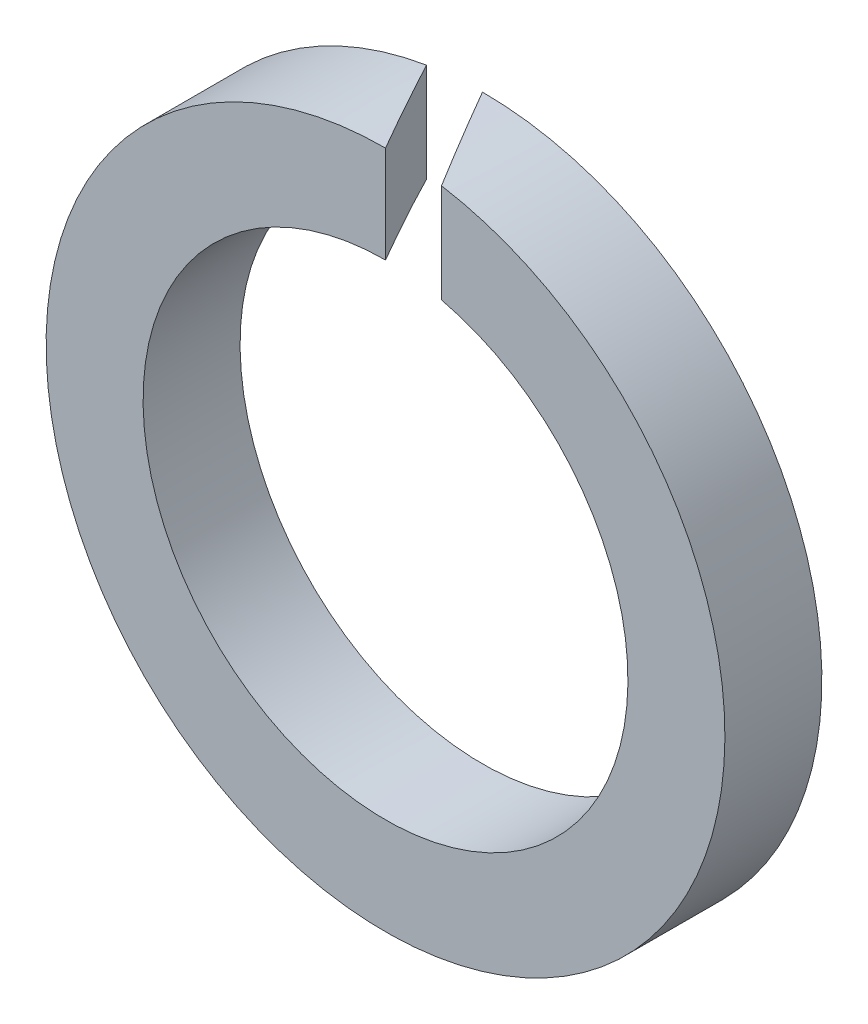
ISO-10303-21;
HEADER;
FILE_DESCRIPTION(('STEP AP214'),'2;1');
FILE_NAME('part.step','',(''),(''),'','','');
FILE_SCHEMA(('AUTOMOTIVE_DESIGN { 1 0 10303 214 1 1 1 1 }'));
ENDSEC;
DATA;
#1=APPLICATION_CONTEXT('core data for automotive mechanical design processes');
#2=APPLICATION_PROTOCOL_DEFINITION('international standard','automotive_design',2000,#1);
#3=PRODUCT_CONTEXT('',#1,'mechanical');
#4=PRODUCT('Part','Part','',(#3));
#5=PRODUCT_RELATED_PRODUCT_CATEGORY('part','',(#4));
#6=PRODUCT_DEFINITION_FORMATION('','',#4);
#7=PRODUCT_DEFINITION_CONTEXT('part definition',#1,'design');
#8=PRODUCT_DEFINITION('design','',#6,#7);
#9=PRODUCT_DEFINITION_SHAPE('','',#8);
#10=(LENGTH_UNIT() NAMED_UNIT(*) SI_UNIT(.MILLI.,.METRE.));
#11=(NAMED_UNIT(*) PLANE_ANGLE_UNIT() SI_UNIT($,.RADIAN.));
#12=(NAMED_UNIT(*) SI_UNIT($,.STERADIAN.) SOLID_ANGLE_UNIT());
#13=UNCERTAINTY_MEASURE_WITH_UNIT(LENGTH_MEASURE(1.E-05),#10,'distance_accuracy_value','');
#14=(GEOMETRIC_REPRESENTATION_CONTEXT(3) GLOBAL_UNCERTAINTY_ASSIGNED_CONTEXT((#13)) GLOBAL_UNIT_ASSIGNED_CONTEXT((#10,
#11,#12)) REPRESENTATION_CONTEXT('',''));
#15=CARTESIAN_POINT('',(0.,0.,0.));
#16=DIRECTION('',(0.,0.,1.));
#17=DIRECTION('',(1.,0.,0.));
#18=AXIS2_PLACEMENT_3D('',#15,#16,#17);
#19=CARTESIAN_POINT('',(0.,0.,-0.6));
#20=DIRECTION('',(0.,0.,1.));
#21=DIRECTION('',(1.,0.,0.));
#22=AXIS2_PLACEMENT_3D('',#19,#20,#21);
#23=CYLINDRICAL_SURFACE('',#22,2.1);
#24=CARTESIAN_POINT('',(0.,0.,0.));
#25=DIRECTION('',(0.,0.,1.));
#26=DIRECTION('',(1.,0.,0.));
#27=AXIS2_PLACEMENT_3D('',#24,#25,#26);
#28=CIRCLE('',#27,2.1);
#29=CARTESIAN_POINT('',(0.,2.1,0.));
#30=VERTEX_POINT('',#29);
#31=CARTESIAN_POINT('',(0.346410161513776,2.0712315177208,0.));
#32=VERTEX_POINT('',#31);
#33=EDGE_CURVE('E95',#30,#32,#28,.T.);
#34=ORIENTED_EDGE('',*,*,#33,.F.);
#35=CARTESIAN_POINT('',(0.,0.,0.));
#36=DIRECTION('',(0.866025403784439,0.,-0.5));
#37=DIRECTION('',(0.5,0.,0.866025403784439));
#38=AXIS2_PLACEMENT_3D('',#35,#36,#37);
#39=ELLIPSE('',#38,4.2,2.1);
#40=CARTESIAN_POINT('',(-0.346410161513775,2.0712315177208,-0.6));
#41=VERTEX_POINT('',#40);
#42=EDGE_CURVE('E77',#30,#41,#39,.F.);
#43=ORIENTED_EDGE('',*,*,#42,.T.);
#44=CARTESIAN_POINT('',(0.,0.,-0.6));
#45=DIRECTION('',(0.,0.,1.));
#46=DIRECTION('',(1.,0.,0.));
#47=AXIS2_PLACEMENT_3D('',#44,#45,#46);
#48=CIRCLE('',#47,2.1);
#49=CARTESIAN_POINT('',(0.,2.1,-0.6));
#50=VERTEX_POINT('',#49);
#51=EDGE_CURVE('E97',#41,#50,#48,.T.);
#52=ORIENTED_EDGE('',*,*,#51,.T.);
#53=CARTESIAN_POINT('',(0.,0.,-0.6));
#54=DIRECTION('',(-0.866025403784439,0.,0.5));
#55=DIRECTION('',(0.5,0.,0.866025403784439));
#56=AXIS2_PLACEMENT_3D('',#53,#54,#55);
#57=ELLIPSE('',#56,4.2,2.1);
#58=EDGE_CURVE('E82',#50,#32,#57,.F.);
#59=ORIENTED_EDGE('',*,*,#58,.T.);
#60=EDGE_LOOP('',(#34,#43,#52,#59));
#61=FACE_BOUND('',#60,.T.);
#62=ADVANCED_FACE('F39',(#61),#23,.T.);
#63=CARTESIAN_POINT('',(0.,0.,-0.6));
#64=DIRECTION('',(0.,0.,1.));
#65=DIRECTION('',(1.,0.,0.));
#66=AXIS2_PLACEMENT_3D('',#63,#64,#65);
#67=PLANE('',#66);
#68=DIRECTION('',(0.,-1.,0.));
#69=VECTOR('',#68,1.);
#70=CARTESIAN_POINT('',(-0.346410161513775,2.1,-0.6));
#71=LINE('',#70,#69);
#72=CARTESIAN_POINT('',(-0.346410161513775,1.45945195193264,-0.6));
#73=VERTEX_POINT('',#72);
#74=EDGE_CURVE('E79',#41,#73,#71,.T.);
#75=ORIENTED_EDGE('',*,*,#74,.T.);
#76=CARTESIAN_POINT('',(0.,0.,-0.6));
#77=DIRECTION('',(0.,0.,1.));
#78=DIRECTION('',(1.,0.,0.));
#79=AXIS2_PLACEMENT_3D('',#76,#77,#78);
#80=CIRCLE('',#79,1.5);
#81=CARTESIAN_POINT('',(0.,1.5,-0.6));
#82=VERTEX_POINT('',#81);
#83=EDGE_CURVE('E96',#73,#82,#80,.T.);
#84=ORIENTED_EDGE('',*,*,#83,.T.);
#85=DIRECTION('',(0.,-1.,0.));
#86=VECTOR('',#85,1.);
#87=CARTESIAN_POINT('',(0.,2.1,-0.6));
#88=LINE('',#87,#86);
#89=EDGE_CURVE('E58',#50,#82,#88,.T.);
#90=ORIENTED_EDGE('',*,*,#89,.F.);
#91=ORIENTED_EDGE('',*,*,#51,.F.);
#92=EDGE_LOOP('',(#75,#84,#90,#91));
#93=FACE_BOUND('',#92,.T.);
#94=ADVANCED_FACE('F113',(#93),#67,.F.);
#95=CARTESIAN_POINT('',(0.,0.,0.));
#96=DIRECTION('',(0.,0.,1.));
#97=DIRECTION('',(1.,0.,0.));
#98=AXIS2_PLACEMENT_3D('',#95,#96,#97);
#99=PLANE('',#98);
#100=CARTESIAN_POINT('',(0.,0.,0.));
#101=DIRECTION('',(0.,0.,1.));
#102=DIRECTION('',(1.,0.,0.));
#103=AXIS2_PLACEMENT_3D('',#100,#101,#102);
#104=CIRCLE('',#103,1.5);
#105=CARTESIAN_POINT('',(0.,1.5,0.));
#106=VERTEX_POINT('',#105);
#107=CARTESIAN_POINT('',(0.346410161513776,1.45945195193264,0.));
#108=VERTEX_POINT('',#107);
#109=EDGE_CURVE('E83',#106,#108,#104,.T.);
#110=ORIENTED_EDGE('',*,*,#109,.F.);
#111=DIRECTION('',(0.,-1.,0.));
#112=VECTOR('',#111,1.);
#113=CARTESIAN_POINT('',(0.,2.1,0.));
#114=LINE('',#113,#112);
#115=EDGE_CURVE('E55',#30,#106,#114,.T.);
#116=ORIENTED_EDGE('',*,*,#115,.F.);
#117=ORIENTED_EDGE('',*,*,#33,.T.);
#118=DIRECTION('',(0.,-1.,0.));
#119=VECTOR('',#118,1.);
#120=CARTESIAN_POINT('',(0.346410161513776,2.1,0.));
#121=LINE('',#120,#119);
#122=EDGE_CURVE('E92',#32,#108,#121,.T.);
#123=ORIENTED_EDGE('',*,*,#122,.T.);
#124=EDGE_LOOP('',(#110,#116,#117,#123));
#125=FACE_BOUND('',#124,.T.);
#126=ADVANCED_FACE('F86',(#125),#99,.T.);
#127=CARTESIAN_POINT('',(0.,0.,-0.6));
#128=DIRECTION('',(0.,0.,1.));
#129=DIRECTION('',(1.,0.,0.));
#130=AXIS2_PLACEMENT_3D('',#127,#128,#129);
#131=CYLINDRICAL_SURFACE('',#130,1.5);
#132=CARTESIAN_POINT('',(0.,0.,0.));
#133=DIRECTION('',(0.866025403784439,0.,-0.5));
#134=DIRECTION('',(0.5,0.,0.866025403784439));
#135=AXIS2_PLACEMENT_3D('',#132,#133,#134);
#136=ELLIPSE('',#135,3.,1.5);
#137=EDGE_CURVE('E11',#106,#73,#136,.F.);
#138=ORIENTED_EDGE('',*,*,#137,.F.);
#139=ORIENTED_EDGE('',*,*,#109,.T.);
#140=CARTESIAN_POINT('',(0.,0.,-0.6));
#141=DIRECTION('',(-0.866025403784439,0.,0.5));
#142=DIRECTION('',(0.5,0.,0.866025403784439));
#143=AXIS2_PLACEMENT_3D('',#140,#141,#142);
#144=ELLIPSE('',#143,3.,1.5);
#145=EDGE_CURVE('E46',#82,#108,#144,.F.);
#146=ORIENTED_EDGE('',*,*,#145,.F.);
#147=ORIENTED_EDGE('',*,*,#83,.F.);
#148=EDGE_LOOP('',(#138,#139,#146,#147));
#149=FACE_BOUND('',#148,.T.);
#150=ADVANCED_FACE('F108',(#149),#131,.F.);
#151=CARTESIAN_POINT('',(0.,2.1,-0.6));
#152=DIRECTION('',(-0.866025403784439,0.,0.5));
#153=DIRECTION('',(0.5,0.,0.866025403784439));
#154=AXIS2_PLACEMENT_3D('',#151,#152,#153);
#155=PLANE('',#154);
#156=ORIENTED_EDGE('',*,*,#89,.T.);
#157=ORIENTED_EDGE('',*,*,#145,.T.);
#158=ORIENTED_EDGE('',*,*,#122,.F.);
#159=ORIENTED_EDGE('',*,*,#58,.F.);
#160=EDGE_LOOP('',(#156,#157,#158,#159));
#161=FACE_BOUND('',#160,.T.);
#162=ADVANCED_FACE('F104',(#161),#155,.T.);
#163=CARTESIAN_POINT('',(0.,2.1,0.));
#164=DIRECTION('',(0.866025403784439,0.,-0.5));
#165=DIRECTION('',(-0.5,0.,-0.866025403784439));
#166=AXIS2_PLACEMENT_3D('',#163,#164,#165);
#167=PLANE('',#166);
#168=ORIENTED_EDGE('',*,*,#115,.T.);
#169=ORIENTED_EDGE('',*,*,#137,.T.);
#170=ORIENTED_EDGE('',*,*,#74,.F.);
#171=ORIENTED_EDGE('',*,*,#42,.F.);
#172=EDGE_LOOP('',(#168,#169,#170,#171));
#173=FACE_BOUND('',#172,.T.);
#174=ADVANCED_FACE('F80',(#173),#167,.T.);
#175=CLOSED_SHELL('',(#62,#94,#126,#150,#162,#174));
#176=MANIFOLD_SOLID_BREP('B2',#175);
#177=ADVANCED_BREP_SHAPE_REPRESENTATION('',(#18,#176),#14);
#178=SHAPE_DEFINITION_REPRESENTATION(#9,#177);
ENDSEC;
END-ISO-10303-21;
